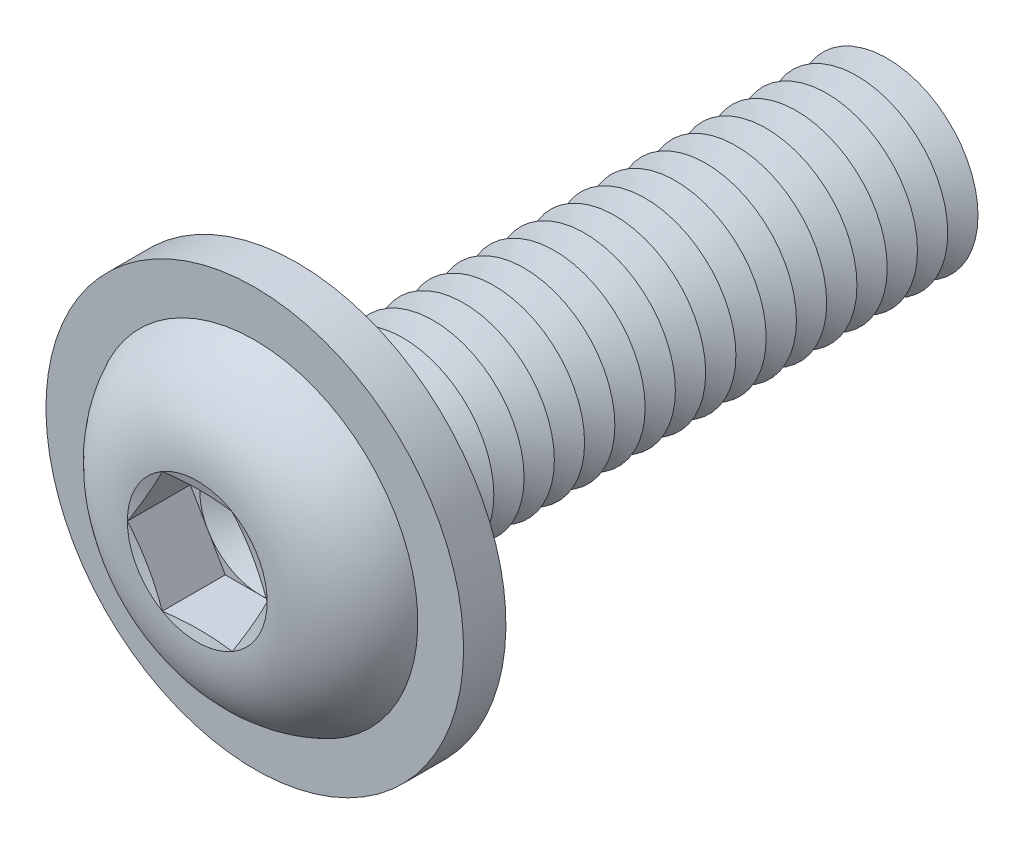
ISO-10303-21;
HEADER;
FILE_DESCRIPTION(('STEP AP214'),'2;1');
FILE_NAME('part.step','',(''),(''),'','','');
FILE_SCHEMA(('AUTOMOTIVE_DESIGN { 1 0 10303 214 1 1 1 1 }'));
ENDSEC;
DATA;
#1=APPLICATION_CONTEXT('core data for automotive mechanical design processes');
#2=APPLICATION_PROTOCOL_DEFINITION('international standard','automotive_design',2000,#1);
#3=PRODUCT_CONTEXT('',#1,'mechanical');
#4=PRODUCT('Part','Part','',(#3));
#5=PRODUCT_RELATED_PRODUCT_CATEGORY('part','',(#4));
#6=PRODUCT_DEFINITION_FORMATION('','',#4);
#7=PRODUCT_DEFINITION_CONTEXT('part definition',#1,'design');
#8=PRODUCT_DEFINITION('design','',#6,#7);
#9=PRODUCT_DEFINITION_SHAPE('','',#8);
#10=(LENGTH_UNIT() NAMED_UNIT(*) SI_UNIT(.MILLI.,.METRE.));
#11=(NAMED_UNIT(*) PLANE_ANGLE_UNIT() SI_UNIT($,.RADIAN.));
#12=(NAMED_UNIT(*) SI_UNIT($,.STERADIAN.) SOLID_ANGLE_UNIT());
#13=UNCERTAINTY_MEASURE_WITH_UNIT(LENGTH_MEASURE(1.E-05),#10,'distance_accuracy_value','');
#14=(GEOMETRIC_REPRESENTATION_CONTEXT(3) GLOBAL_UNCERTAINTY_ASSIGNED_CONTEXT((#13)) GLOBAL_UNIT_ASSIGNED_CONTEXT((#10,
#11,#12)) REPRESENTATION_CONTEXT('',''));
#15=CARTESIAN_POINT('',(0.,0.,0.));
#16=DIRECTION('',(0.,0.,1.));
#17=DIRECTION('',(1.,0.,0.));
#18=AXIS2_PLACEMENT_3D('',#15,#16,#17);
#19=CARTESIAN_POINT('',(0.,0.,-8.25));
#20=DIRECTION('',(0.,0.,1.));
#21=DIRECTION('',(1.,0.,0.));
#22=AXIS2_PLACEMENT_3D('',#19,#20,#21);
#23=CONICAL_SURFACE('',#22,1.5,1.0471975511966);
#24=CARTESIAN_POINT('',(0.,0.,-8.5));
#25=DIRECTION('',(0.,0.,1.));
#26=DIRECTION('',(1.,0.,0.));
#27=AXIS2_PLACEMENT_3D('',#24,#25,#26);
#28=CIRCLE('',#27,1.06698729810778);
#29=CARTESIAN_POINT('',(1.06698729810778,0.,-8.5));
#30=VERTEX_POINT('',#29);
#31=EDGE_CURVE('E370',#30,#30,#28,.T.);
#32=ORIENTED_EDGE('',*,*,#31,.T.);
#33=EDGE_LOOP('',(#32));
#34=FACE_BOUND('',#33,.T.);
#35=CARTESIAN_POINT('',(0.,0.,-8.25));
#36=DIRECTION('',(0.,0.,1.));
#37=DIRECTION('',(1.,0.,0.));
#38=AXIS2_PLACEMENT_3D('',#35,#36,#37);
#39=CIRCLE('',#38,1.5);
#40=CARTESIAN_POINT('',(1.5,0.,-8.25));
#41=VERTEX_POINT('',#40);
#42=EDGE_CURVE('E366',#41,#41,#39,.T.);
#43=ORIENTED_EDGE('',*,*,#42,.F.);
#44=EDGE_LOOP('',(#43));
#45=FACE_BOUND('',#44,.T.);
#46=ADVANCED_FACE('F39',(#34,#45),#23,.T.);
#47=CARTESIAN_POINT('',(0.,0.,-8.5));
#48=DIRECTION('',(0.,0.,-1.));
#49=DIRECTION('',(-1.,0.,0.));
#50=AXIS2_PLACEMENT_3D('',#47,#48,#49);
#51=CONICAL_SURFACE('',#50,1.06698729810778,1.0471975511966);
#52=CARTESIAN_POINT('',(0.,0.,-8.75));
#53=DIRECTION('',(0.,0.,1.));
#54=DIRECTION('',(1.,0.,0.));
#55=AXIS2_PLACEMENT_3D('',#52,#53,#54);
#56=CIRCLE('',#55,1.5);
#57=CARTESIAN_POINT('',(1.5,0.,-8.75));
#58=VERTEX_POINT('',#57);
#59=EDGE_CURVE('E374',#58,#58,#56,.T.);
#60=ORIENTED_EDGE('',*,*,#59,.T.);
#61=EDGE_LOOP('',(#60));
#62=FACE_BOUND('',#61,.T.);
#63=ORIENTED_EDGE('',*,*,#31,.F.);
#64=EDGE_LOOP('',(#63));
#65=FACE_BOUND('',#64,.T.);
#66=ADVANCED_FACE('F509',(#62,#65),#51,.T.);
#67=CARTESIAN_POINT('',(0.,1.50000000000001,-10.));
#68=DIRECTION('',(0.,0.,-1.));
#69=DIRECTION('',(-1.,0.,0.));
#70=AXIS2_PLACEMENT_3D('',#67,#68,#69);
#71=PLANE('',#70);
#72=CARTESIAN_POINT('',(0.,0.,-10.));
#73=DIRECTION('',(0.,0.,1.));
#74=DIRECTION('',(1.,0.,0.));
#75=AXIS2_PLACEMENT_3D('',#72,#73,#74);
#76=CIRCLE('',#75,1.06698729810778);
#77=CARTESIAN_POINT('',(1.06698729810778,0.,-10.));
#78=VERTEX_POINT('',#77);
#79=EDGE_CURVE('E394',#78,#78,#76,.T.);
#80=ORIENTED_EDGE('',*,*,#79,.F.);
#81=EDGE_LOOP('',(#80));
#82=FACE_BOUND('',#81,.T.);
#83=ADVANCED_FACE('F515',(#82),#71,.T.);
#84=CARTESIAN_POINT('',(0.,0.,-9.75));
#85=DIRECTION('',(0.,0.,1.));
#86=DIRECTION('',(1.,0.,0.));
#87=AXIS2_PLACEMENT_3D('',#84,#85,#86);
#88=CONICAL_SURFACE('',#87,1.5,1.0471975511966);
#89=ORIENTED_EDGE('',*,*,#79,.T.);
#90=EDGE_LOOP('',(#89));
#91=FACE_BOUND('',#90,.T.);
#92=CARTESIAN_POINT('',(0.,0.,-9.75));
#93=DIRECTION('',(0.,0.,1.));
#94=DIRECTION('',(1.,0.,0.));
#95=AXIS2_PLACEMENT_3D('',#92,#93,#94);
#96=CIRCLE('',#95,1.5);
#97=CARTESIAN_POINT('',(1.5,0.,-9.75));
#98=VERTEX_POINT('',#97);
#99=EDGE_CURVE('E390',#98,#98,#96,.T.);
#100=ORIENTED_EDGE('',*,*,#99,.F.);
#101=EDGE_LOOP('',(#100));
#102=FACE_BOUND('',#101,.T.);
#103=ADVANCED_FACE('F534',(#91,#102),#88,.T.);
#104=CARTESIAN_POINT('',(0.,0.,-9.5));
#105=DIRECTION('',(0.,0.,-1.));
#106=DIRECTION('',(-1.,0.,0.));
#107=AXIS2_PLACEMENT_3D('',#104,#105,#106);
#108=CONICAL_SURFACE('',#107,1.06698729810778,1.0471975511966);
#109=ORIENTED_EDGE('',*,*,#99,.T.);
#110=EDGE_LOOP('',(#109));
#111=FACE_BOUND('',#110,.T.);
#112=CARTESIAN_POINT('',(0.,0.,-9.5));
#113=DIRECTION('',(0.,0.,1.));
#114=DIRECTION('',(1.,0.,0.));
#115=AXIS2_PLACEMENT_3D('',#112,#113,#114);
#116=CIRCLE('',#115,1.06698729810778);
#117=CARTESIAN_POINT('',(1.06698729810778,0.,-9.5));
#118=VERTEX_POINT('',#117);
#119=EDGE_CURVE('E386',#118,#118,#116,.T.);
#120=ORIENTED_EDGE('',*,*,#119,.F.);
#121=EDGE_LOOP('',(#120));
#122=FACE_BOUND('',#121,.T.);
#123=ADVANCED_FACE('F531',(#111,#122),#108,.T.);
#124=CARTESIAN_POINT('',(0.,0.,-9.25));
#125=DIRECTION('',(0.,0.,1.));
#126=DIRECTION('',(1.,0.,0.));
#127=AXIS2_PLACEMENT_3D('',#124,#125,#126);
#128=CONICAL_SURFACE('',#127,1.5,1.0471975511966);
#129=ORIENTED_EDGE('',*,*,#119,.T.);
#130=EDGE_LOOP('',(#129));
#131=FACE_BOUND('',#130,.T.);
#132=CARTESIAN_POINT('',(0.,0.,-9.25));
#133=DIRECTION('',(0.,0.,1.));
#134=DIRECTION('',(1.,0.,0.));
#135=AXIS2_PLACEMENT_3D('',#132,#133,#134);
#136=CIRCLE('',#135,1.5);
#137=CARTESIAN_POINT('',(1.5,0.,-9.25));
#138=VERTEX_POINT('',#137);
#139=EDGE_CURVE('E382',#138,#138,#136,.T.);
#140=ORIENTED_EDGE('',*,*,#139,.F.);
#141=EDGE_LOOP('',(#140));
#142=FACE_BOUND('',#141,.T.);
#143=ADVANCED_FACE('F525',(#131,#142),#128,.T.);
#144=CARTESIAN_POINT('',(0.,0.,-9.));
#145=DIRECTION('',(0.,0.,-1.));
#146=DIRECTION('',(-1.,0.,0.));
#147=AXIS2_PLACEMENT_3D('',#144,#145,#146);
#148=CONICAL_SURFACE('',#147,1.06698729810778,1.0471975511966);
#149=ORIENTED_EDGE('',*,*,#139,.T.);
#150=EDGE_LOOP('',(#149));
#151=FACE_BOUND('',#150,.T.);
#152=CARTESIAN_POINT('',(0.,0.,-9.));
#153=DIRECTION('',(0.,0.,1.));
#154=DIRECTION('',(1.,0.,0.));
#155=AXIS2_PLACEMENT_3D('',#152,#153,#154);
#156=CIRCLE('',#155,1.06698729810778);
#157=CARTESIAN_POINT('',(1.06698729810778,0.,-9.));
#158=VERTEX_POINT('',#157);
#159=EDGE_CURVE('E378',#158,#158,#156,.T.);
#160=ORIENTED_EDGE('',*,*,#159,.F.);
#161=EDGE_LOOP('',(#160));
#162=FACE_BOUND('',#161,.T.);
#163=ADVANCED_FACE('F521',(#151,#162),#148,.T.);
#164=CARTESIAN_POINT('',(0.,0.,-8.75));
#165=DIRECTION('',(0.,0.,1.));
#166=DIRECTION('',(1.,0.,0.));
#167=AXIS2_PLACEMENT_3D('',#164,#165,#166);
#168=CONICAL_SURFACE('',#167,1.5,1.0471975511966);
#169=ORIENTED_EDGE('',*,*,#159,.T.);
#170=EDGE_LOOP('',(#169));
#171=FACE_BOUND('',#170,.T.);
#172=ORIENTED_EDGE('',*,*,#59,.F.);
#173=EDGE_LOOP('',(#172));
#174=FACE_BOUND('',#173,.T.);
#175=ADVANCED_FACE('F524',(#171,#174),#168,.T.);
#176=CARTESIAN_POINT('',(0.,0.,-7.75));
#177=DIRECTION('',(0.,0.,1.));
#178=DIRECTION('',(1.,0.,0.));
#179=AXIS2_PLACEMENT_3D('',#176,#177,#178);
#180=CONICAL_SURFACE('',#179,1.5,1.0471975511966);
#181=CARTESIAN_POINT('',(0.,0.,-8.));
#182=DIRECTION('',(0.,0.,1.));
#183=DIRECTION('',(1.,0.,0.));
#184=AXIS2_PLACEMENT_3D('',#181,#182,#183);
#185=CIRCLE('',#184,1.06698729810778);
#186=CARTESIAN_POINT('',(1.06698729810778,0.,-8.));
#187=VERTEX_POINT('',#186);
#188=EDGE_CURVE('E362',#187,#187,#185,.T.);
#189=ORIENTED_EDGE('',*,*,#188,.T.);
#190=EDGE_LOOP('',(#189));
#191=FACE_BOUND('',#190,.T.);
#192=CARTESIAN_POINT('',(0.,0.,-7.75));
#193=DIRECTION('',(0.,0.,1.));
#194=DIRECTION('',(1.,0.,0.));
#195=AXIS2_PLACEMENT_3D('',#192,#193,#194);
#196=CIRCLE('',#195,1.5);
#197=CARTESIAN_POINT('',(1.5,0.,-7.75));
#198=VERTEX_POINT('',#197);
#199=EDGE_CURVE('E358',#198,#198,#196,.T.);
#200=ORIENTED_EDGE('',*,*,#199,.F.);
#201=EDGE_LOOP('',(#200));
#202=FACE_BOUND('',#201,.T.);
#203=ADVANCED_FACE('F529',(#191,#202),#180,.T.);
#204=CARTESIAN_POINT('',(0.,0.,-8.));
#205=DIRECTION('',(0.,0.,-1.));
#206=DIRECTION('',(-1.,0.,0.));
#207=AXIS2_PLACEMENT_3D('',#204,#205,#206);
#208=CONICAL_SURFACE('',#207,1.06698729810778,1.0471975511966);
#209=ORIENTED_EDGE('',*,*,#42,.T.);
#210=EDGE_LOOP('',(#209));
#211=FACE_BOUND('',#210,.T.);
#212=ORIENTED_EDGE('',*,*,#188,.F.);
#213=EDGE_LOOP('',(#212));
#214=FACE_BOUND('',#213,.T.);
#215=ADVANCED_FACE('F580',(#211,#214),#208,.T.);
#216=CARTESIAN_POINT('',(0.,0.,-7.25));
#217=DIRECTION('',(0.,0.,1.));
#218=DIRECTION('',(1.,0.,0.));
#219=AXIS2_PLACEMENT_3D('',#216,#217,#218);
#220=CONICAL_SURFACE('',#219,1.5,1.0471975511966);
#221=CARTESIAN_POINT('',(0.,0.,-7.5));
#222=DIRECTION('',(0.,0.,1.));
#223=DIRECTION('',(1.,0.,0.));
#224=AXIS2_PLACEMENT_3D('',#221,#222,#223);
#225=CIRCLE('',#224,1.06698729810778);
#226=CARTESIAN_POINT('',(1.06698729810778,0.,-7.5));
#227=VERTEX_POINT('',#226);
#228=EDGE_CURVE('E354',#227,#227,#225,.T.);
#229=ORIENTED_EDGE('',*,*,#228,.T.);
#230=EDGE_LOOP('',(#229));
#231=FACE_BOUND('',#230,.T.);
#232=CARTESIAN_POINT('',(0.,0.,-7.25));
#233=DIRECTION('',(0.,0.,1.));
#234=DIRECTION('',(1.,0.,0.));
#235=AXIS2_PLACEMENT_3D('',#232,#233,#234);
#236=CIRCLE('',#235,1.5);
#237=CARTESIAN_POINT('',(1.5,0.,-7.25));
#238=VERTEX_POINT('',#237);
#239=EDGE_CURVE('E350',#238,#238,#236,.T.);
#240=ORIENTED_EDGE('',*,*,#239,.F.);
#241=EDGE_LOOP('',(#240));
#242=FACE_BOUND('',#241,.T.);
#243=ADVANCED_FACE('F586',(#231,#242),#220,.T.);
#244=CARTESIAN_POINT('',(0.,0.,-7.5));
#245=DIRECTION('',(0.,0.,-1.));
#246=DIRECTION('',(-1.,0.,0.));
#247=AXIS2_PLACEMENT_3D('',#244,#245,#246);
#248=CONICAL_SURFACE('',#247,1.06698729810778,1.0471975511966);
#249=ORIENTED_EDGE('',*,*,#199,.T.);
#250=EDGE_LOOP('',(#249));
#251=FACE_BOUND('',#250,.T.);
#252=ORIENTED_EDGE('',*,*,#228,.F.);
#253=EDGE_LOOP('',(#252));
#254=FACE_BOUND('',#253,.T.);
#255=ADVANCED_FACE('F593',(#251,#254),#248,.T.);
#256=CARTESIAN_POINT('',(0.,0.,-6.75));
#257=DIRECTION('',(0.,0.,1.));
#258=DIRECTION('',(1.,0.,0.));
#259=AXIS2_PLACEMENT_3D('',#256,#257,#258);
#260=CONICAL_SURFACE('',#259,1.5,1.0471975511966);
#261=CARTESIAN_POINT('',(0.,0.,-7.));
#262=DIRECTION('',(0.,0.,1.));
#263=DIRECTION('',(1.,0.,0.));
#264=AXIS2_PLACEMENT_3D('',#261,#262,#263);
#265=CIRCLE('',#264,1.06698729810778);
#266=CARTESIAN_POINT('',(1.06698729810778,0.,-7.));
#267=VERTEX_POINT('',#266);
#268=EDGE_CURVE('E346',#267,#267,#265,.T.);
#269=ORIENTED_EDGE('',*,*,#268,.T.);
#270=EDGE_LOOP('',(#269));
#271=FACE_BOUND('',#270,.T.);
#272=CARTESIAN_POINT('',(0.,0.,-6.75));
#273=DIRECTION('',(0.,0.,1.));
#274=DIRECTION('',(1.,0.,0.));
#275=AXIS2_PLACEMENT_3D('',#272,#273,#274);
#276=CIRCLE('',#275,1.5);
#277=CARTESIAN_POINT('',(1.5,0.,-6.75));
#278=VERTEX_POINT('',#277);
#279=EDGE_CURVE('E342',#278,#278,#276,.T.);
#280=ORIENTED_EDGE('',*,*,#279,.F.);
#281=EDGE_LOOP('',(#280));
#282=FACE_BOUND('',#281,.T.);
#283=ADVANCED_FACE('F600',(#271,#282),#260,.T.);
#284=CARTESIAN_POINT('',(0.,0.,-7.));
#285=DIRECTION('',(0.,0.,-1.));
#286=DIRECTION('',(-1.,0.,0.));
#287=AXIS2_PLACEMENT_3D('',#284,#285,#286);
#288=CONICAL_SURFACE('',#287,1.06698729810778,1.0471975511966);
#289=ORIENTED_EDGE('',*,*,#239,.T.);
#290=EDGE_LOOP('',(#289));
#291=FACE_BOUND('',#290,.T.);
#292=ORIENTED_EDGE('',*,*,#268,.F.);
#293=EDGE_LOOP('',(#292));
#294=FACE_BOUND('',#293,.T.);
#295=ADVANCED_FACE('F607',(#291,#294),#288,.T.);
#296=CARTESIAN_POINT('',(0.,0.,-6.25));
#297=DIRECTION('',(0.,0.,1.));
#298=DIRECTION('',(1.,0.,0.));
#299=AXIS2_PLACEMENT_3D('',#296,#297,#298);
#300=CONICAL_SURFACE('',#299,1.5,1.0471975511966);
#301=CARTESIAN_POINT('',(0.,0.,-6.5));
#302=DIRECTION('',(0.,0.,1.));
#303=DIRECTION('',(1.,0.,0.));
#304=AXIS2_PLACEMENT_3D('',#301,#302,#303);
#305=CIRCLE('',#304,1.06698729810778);
#306=CARTESIAN_POINT('',(1.06698729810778,0.,-6.5));
#307=VERTEX_POINT('',#306);
#308=EDGE_CURVE('E338',#307,#307,#305,.T.);
#309=ORIENTED_EDGE('',*,*,#308,.T.);
#310=EDGE_LOOP('',(#309));
#311=FACE_BOUND('',#310,.T.);
#312=CARTESIAN_POINT('',(0.,0.,-6.25));
#313=DIRECTION('',(0.,0.,1.));
#314=DIRECTION('',(1.,0.,0.));
#315=AXIS2_PLACEMENT_3D('',#312,#313,#314);
#316=CIRCLE('',#315,1.5);
#317=CARTESIAN_POINT('',(1.5,0.,-6.25));
#318=VERTEX_POINT('',#317);
#319=EDGE_CURVE('E334',#318,#318,#316,.T.);
#320=ORIENTED_EDGE('',*,*,#319,.F.);
#321=EDGE_LOOP('',(#320));
#322=FACE_BOUND('',#321,.T.);
#323=ADVANCED_FACE('F614',(#311,#322),#300,.T.);
#324=CARTESIAN_POINT('',(0.,0.,-6.5));
#325=DIRECTION('',(0.,0.,-1.));
#326=DIRECTION('',(-1.,0.,0.));
#327=AXIS2_PLACEMENT_3D('',#324,#325,#326);
#328=CONICAL_SURFACE('',#327,1.06698729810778,1.0471975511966);
#329=ORIENTED_EDGE('',*,*,#279,.T.);
#330=EDGE_LOOP('',(#329));
#331=FACE_BOUND('',#330,.T.);
#332=ORIENTED_EDGE('',*,*,#308,.F.);
#333=EDGE_LOOP('',(#332));
#334=FACE_BOUND('',#333,.T.);
#335=ADVANCED_FACE('F621',(#331,#334),#328,.T.);
#336=CARTESIAN_POINT('',(0.,0.,-5.75));
#337=DIRECTION('',(0.,0.,1.));
#338=DIRECTION('',(1.,0.,0.));
#339=AXIS2_PLACEMENT_3D('',#336,#337,#338);
#340=CONICAL_SURFACE('',#339,1.5,1.0471975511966);
#341=CARTESIAN_POINT('',(0.,0.,-6.));
#342=DIRECTION('',(0.,0.,1.));
#343=DIRECTION('',(1.,0.,0.));
#344=AXIS2_PLACEMENT_3D('',#341,#342,#343);
#345=CIRCLE('',#344,1.06698729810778);
#346=CARTESIAN_POINT('',(1.06698729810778,0.,-6.));
#347=VERTEX_POINT('',#346);
#348=EDGE_CURVE('E330',#347,#347,#345,.T.);
#349=ORIENTED_EDGE('',*,*,#348,.T.);
#350=EDGE_LOOP('',(#349));
#351=FACE_BOUND('',#350,.T.);
#352=CARTESIAN_POINT('',(0.,0.,-5.75));
#353=DIRECTION('',(0.,0.,1.));
#354=DIRECTION('',(1.,0.,0.));
#355=AXIS2_PLACEMENT_3D('',#352,#353,#354);
#356=CIRCLE('',#355,1.5);
#357=CARTESIAN_POINT('',(1.5,0.,-5.75));
#358=VERTEX_POINT('',#357);
#359=EDGE_CURVE('E326',#358,#358,#356,.T.);
#360=ORIENTED_EDGE('',*,*,#359,.F.);
#361=EDGE_LOOP('',(#360));
#362=FACE_BOUND('',#361,.T.);
#363=ADVANCED_FACE('F628',(#351,#362),#340,.T.);
#364=CARTESIAN_POINT('',(0.,0.,-6.));
#365=DIRECTION('',(0.,0.,-1.));
#366=DIRECTION('',(-1.,0.,0.));
#367=AXIS2_PLACEMENT_3D('',#364,#365,#366);
#368=CONICAL_SURFACE('',#367,1.06698729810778,1.0471975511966);
#369=ORIENTED_EDGE('',*,*,#319,.T.);
#370=EDGE_LOOP('',(#369));
#371=FACE_BOUND('',#370,.T.);
#372=ORIENTED_EDGE('',*,*,#348,.F.);
#373=EDGE_LOOP('',(#372));
#374=FACE_BOUND('',#373,.T.);
#375=ADVANCED_FACE('F635',(#371,#374),#368,.T.);
#376=CARTESIAN_POINT('',(0.,0.,-5.25));
#377=DIRECTION('',(0.,0.,1.));
#378=DIRECTION('',(1.,0.,0.));
#379=AXIS2_PLACEMENT_3D('',#376,#377,#378);
#380=CONICAL_SURFACE('',#379,1.5,1.0471975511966);
#381=CARTESIAN_POINT('',(0.,0.,-5.5));
#382=DIRECTION('',(0.,0.,1.));
#383=DIRECTION('',(1.,0.,0.));
#384=AXIS2_PLACEMENT_3D('',#381,#382,#383);
#385=CIRCLE('',#384,1.06698729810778);
#386=CARTESIAN_POINT('',(1.06698729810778,0.,-5.5));
#387=VERTEX_POINT('',#386);
#388=EDGE_CURVE('E322',#387,#387,#385,.T.);
#389=ORIENTED_EDGE('',*,*,#388,.T.);
#390=EDGE_LOOP('',(#389));
#391=FACE_BOUND('',#390,.T.);
#392=CARTESIAN_POINT('',(0.,0.,-5.25));
#393=DIRECTION('',(0.,0.,1.));
#394=DIRECTION('',(1.,0.,0.));
#395=AXIS2_PLACEMENT_3D('',#392,#393,#394);
#396=CIRCLE('',#395,1.5);
#397=CARTESIAN_POINT('',(1.5,0.,-5.25));
#398=VERTEX_POINT('',#397);
#399=EDGE_CURVE('E318',#398,#398,#396,.T.);
#400=ORIENTED_EDGE('',*,*,#399,.F.);
#401=EDGE_LOOP('',(#400));
#402=FACE_BOUND('',#401,.T.);
#403=ADVANCED_FACE('F642',(#391,#402),#380,.T.);
#404=CARTESIAN_POINT('',(0.,0.,-5.5));
#405=DIRECTION('',(0.,0.,-1.));
#406=DIRECTION('',(-1.,0.,0.));
#407=AXIS2_PLACEMENT_3D('',#404,#405,#406);
#408=CONICAL_SURFACE('',#407,1.06698729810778,1.0471975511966);
#409=ORIENTED_EDGE('',*,*,#359,.T.);
#410=EDGE_LOOP('',(#409));
#411=FACE_BOUND('',#410,.T.);
#412=ORIENTED_EDGE('',*,*,#388,.F.);
#413=EDGE_LOOP('',(#412));
#414=FACE_BOUND('',#413,.T.);
#415=ADVANCED_FACE('F649',(#411,#414),#408,.T.);
#416=CARTESIAN_POINT('',(0.,0.,-4.75));
#417=DIRECTION('',(0.,0.,1.));
#418=DIRECTION('',(1.,0.,0.));
#419=AXIS2_PLACEMENT_3D('',#416,#417,#418);
#420=CONICAL_SURFACE('',#419,1.5,1.0471975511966);
#421=CARTESIAN_POINT('',(0.,0.,-5.));
#422=DIRECTION('',(0.,0.,1.));
#423=DIRECTION('',(1.,0.,0.));
#424=AXIS2_PLACEMENT_3D('',#421,#422,#423);
#425=CIRCLE('',#424,1.06698729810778);
#426=CARTESIAN_POINT('',(1.06698729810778,0.,-5.));
#427=VERTEX_POINT('',#426);
#428=EDGE_CURVE('E314',#427,#427,#425,.T.);
#429=ORIENTED_EDGE('',*,*,#428,.T.);
#430=EDGE_LOOP('',(#429));
#431=FACE_BOUND('',#430,.T.);
#432=CARTESIAN_POINT('',(0.,0.,-4.75));
#433=DIRECTION('',(0.,0.,1.));
#434=DIRECTION('',(1.,0.,0.));
#435=AXIS2_PLACEMENT_3D('',#432,#433,#434);
#436=CIRCLE('',#435,1.5);
#437=CARTESIAN_POINT('',(1.5,0.,-4.75));
#438=VERTEX_POINT('',#437);
#439=EDGE_CURVE('E310',#438,#438,#436,.T.);
#440=ORIENTED_EDGE('',*,*,#439,.F.);
#441=EDGE_LOOP('',(#440));
#442=FACE_BOUND('',#441,.T.);
#443=ADVANCED_FACE('F656',(#431,#442),#420,.T.);
#444=CARTESIAN_POINT('',(0.,0.,-5.));
#445=DIRECTION('',(0.,0.,-1.));
#446=DIRECTION('',(-1.,0.,0.));
#447=AXIS2_PLACEMENT_3D('',#444,#445,#446);
#448=CONICAL_SURFACE('',#447,1.06698729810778,1.0471975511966);
#449=ORIENTED_EDGE('',*,*,#399,.T.);
#450=EDGE_LOOP('',(#449));
#451=FACE_BOUND('',#450,.T.);
#452=ORIENTED_EDGE('',*,*,#428,.F.);
#453=EDGE_LOOP('',(#452));
#454=FACE_BOUND('',#453,.T.);
#455=ADVANCED_FACE('F663',(#451,#454),#448,.T.);
#456=CARTESIAN_POINT('',(0.,0.,-4.25));
#457=DIRECTION('',(0.,0.,1.));
#458=DIRECTION('',(1.,0.,0.));
#459=AXIS2_PLACEMENT_3D('',#456,#457,#458);
#460=CONICAL_SURFACE('',#459,1.5,1.0471975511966);
#461=CARTESIAN_POINT('',(0.,0.,-4.5));
#462=DIRECTION('',(0.,0.,1.));
#463=DIRECTION('',(1.,0.,0.));
#464=AXIS2_PLACEMENT_3D('',#461,#462,#463);
#465=CIRCLE('',#464,1.06698729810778);
#466=CARTESIAN_POINT('',(1.06698729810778,0.,-4.5));
#467=VERTEX_POINT('',#466);
#468=EDGE_CURVE('E306',#467,#467,#465,.T.);
#469=ORIENTED_EDGE('',*,*,#468,.T.);
#470=EDGE_LOOP('',(#469));
#471=FACE_BOUND('',#470,.T.);
#472=CARTESIAN_POINT('',(0.,0.,-4.25));
#473=DIRECTION('',(0.,0.,1.));
#474=DIRECTION('',(1.,0.,0.));
#475=AXIS2_PLACEMENT_3D('',#472,#473,#474);
#476=CIRCLE('',#475,1.5);
#477=CARTESIAN_POINT('',(1.5,0.,-4.25));
#478=VERTEX_POINT('',#477);
#479=EDGE_CURVE('E302',#478,#478,#476,.T.);
#480=ORIENTED_EDGE('',*,*,#479,.F.);
#481=EDGE_LOOP('',(#480));
#482=FACE_BOUND('',#481,.T.);
#483=ADVANCED_FACE('F670',(#471,#482),#460,.T.);
#484=CARTESIAN_POINT('',(0.,0.,-4.5));
#485=DIRECTION('',(0.,0.,-1.));
#486=DIRECTION('',(-1.,0.,0.));
#487=AXIS2_PLACEMENT_3D('',#484,#485,#486);
#488=CONICAL_SURFACE('',#487,1.06698729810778,1.0471975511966);
#489=ORIENTED_EDGE('',*,*,#439,.T.);
#490=EDGE_LOOP('',(#489));
#491=FACE_BOUND('',#490,.T.);
#492=ORIENTED_EDGE('',*,*,#468,.F.);
#493=EDGE_LOOP('',(#492));
#494=FACE_BOUND('',#493,.T.);
#495=ADVANCED_FACE('F677',(#491,#494),#488,.T.);
#496=CARTESIAN_POINT('',(0.,0.,-3.75));
#497=DIRECTION('',(0.,0.,1.));
#498=DIRECTION('',(1.,0.,0.));
#499=AXIS2_PLACEMENT_3D('',#496,#497,#498);
#500=CONICAL_SURFACE('',#499,1.5,1.0471975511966);
#501=CARTESIAN_POINT('',(0.,0.,-4.));
#502=DIRECTION('',(0.,0.,1.));
#503=DIRECTION('',(1.,0.,0.));
#504=AXIS2_PLACEMENT_3D('',#501,#502,#503);
#505=CIRCLE('',#504,1.06698729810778);
#506=CARTESIAN_POINT('',(1.06698729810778,0.,-4.));
#507=VERTEX_POINT('',#506);
#508=EDGE_CURVE('E298',#507,#507,#505,.T.);
#509=ORIENTED_EDGE('',*,*,#508,.T.);
#510=EDGE_LOOP('',(#509));
#511=FACE_BOUND('',#510,.T.);
#512=CARTESIAN_POINT('',(0.,0.,-3.75));
#513=DIRECTION('',(0.,0.,1.));
#514=DIRECTION('',(1.,0.,0.));
#515=AXIS2_PLACEMENT_3D('',#512,#513,#514);
#516=CIRCLE('',#515,1.5);
#517=CARTESIAN_POINT('',(1.5,0.,-3.75));
#518=VERTEX_POINT('',#517);
#519=EDGE_CURVE('E294',#518,#518,#516,.T.);
#520=ORIENTED_EDGE('',*,*,#519,.F.);
#521=EDGE_LOOP('',(#520));
#522=FACE_BOUND('',#521,.T.);
#523=ADVANCED_FACE('F684',(#511,#522),#500,.T.);
#524=CARTESIAN_POINT('',(0.,0.,-4.));
#525=DIRECTION('',(0.,0.,-1.));
#526=DIRECTION('',(-1.,0.,0.));
#527=AXIS2_PLACEMENT_3D('',#524,#525,#526);
#528=CONICAL_SURFACE('',#527,1.06698729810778,1.0471975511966);
#529=ORIENTED_EDGE('',*,*,#479,.T.);
#530=EDGE_LOOP('',(#529));
#531=FACE_BOUND('',#530,.T.);
#532=ORIENTED_EDGE('',*,*,#508,.F.);
#533=EDGE_LOOP('',(#532));
#534=FACE_BOUND('',#533,.T.);
#535=ADVANCED_FACE('F691',(#531,#534),#528,.T.);
#536=CARTESIAN_POINT('',(0.,0.,-3.25));
#537=DIRECTION('',(0.,0.,1.));
#538=DIRECTION('',(1.,0.,0.));
#539=AXIS2_PLACEMENT_3D('',#536,#537,#538);
#540=CONICAL_SURFACE('',#539,1.5,1.0471975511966);
#541=CARTESIAN_POINT('',(0.,0.,-3.5));
#542=DIRECTION('',(0.,0.,1.));
#543=DIRECTION('',(1.,0.,0.));
#544=AXIS2_PLACEMENT_3D('',#541,#542,#543);
#545=CIRCLE('',#544,1.06698729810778);
#546=CARTESIAN_POINT('',(1.06698729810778,0.,-3.5));
#547=VERTEX_POINT('',#546);
#548=EDGE_CURVE('E290',#547,#547,#545,.T.);
#549=ORIENTED_EDGE('',*,*,#548,.T.);
#550=EDGE_LOOP('',(#549));
#551=FACE_BOUND('',#550,.T.);
#552=CARTESIAN_POINT('',(0.,0.,-3.25));
#553=DIRECTION('',(0.,0.,1.));
#554=DIRECTION('',(1.,0.,0.));
#555=AXIS2_PLACEMENT_3D('',#552,#553,#554);
#556=CIRCLE('',#555,1.5);
#557=CARTESIAN_POINT('',(1.5,0.,-3.25));
#558=VERTEX_POINT('',#557);
#559=EDGE_CURVE('E286',#558,#558,#556,.T.);
#560=ORIENTED_EDGE('',*,*,#559,.F.);
#561=EDGE_LOOP('',(#560));
#562=FACE_BOUND('',#561,.T.);
#563=ADVANCED_FACE('F698',(#551,#562),#540,.T.);
#564=CARTESIAN_POINT('',(0.,0.,-3.5));
#565=DIRECTION('',(0.,0.,-1.));
#566=DIRECTION('',(-1.,0.,0.));
#567=AXIS2_PLACEMENT_3D('',#564,#565,#566);
#568=CONICAL_SURFACE('',#567,1.06698729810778,1.0471975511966);
#569=ORIENTED_EDGE('',*,*,#519,.T.);
#570=EDGE_LOOP('',(#569));
#571=FACE_BOUND('',#570,.T.);
#572=ORIENTED_EDGE('',*,*,#548,.F.);
#573=EDGE_LOOP('',(#572));
#574=FACE_BOUND('',#573,.T.);
#575=ADVANCED_FACE('F705',(#571,#574),#568,.T.);
#576=CARTESIAN_POINT('',(0.,0.,-2.75));
#577=DIRECTION('',(0.,0.,1.));
#578=DIRECTION('',(1.,0.,0.));
#579=AXIS2_PLACEMENT_3D('',#576,#577,#578);
#580=CONICAL_SURFACE('',#579,1.5,1.0471975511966);
#581=CARTESIAN_POINT('',(0.,0.,-3.));
#582=DIRECTION('',(0.,0.,1.));
#583=DIRECTION('',(1.,0.,0.));
#584=AXIS2_PLACEMENT_3D('',#581,#582,#583);
#585=CIRCLE('',#584,1.06698729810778);
#586=CARTESIAN_POINT('',(1.06698729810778,0.,-3.));
#587=VERTEX_POINT('',#586);
#588=EDGE_CURVE('E283',#587,#587,#585,.T.);
#589=ORIENTED_EDGE('',*,*,#588,.T.);
#590=EDGE_LOOP('',(#589));
#591=FACE_BOUND('',#590,.T.);
#592=CARTESIAN_POINT('',(0.,0.,-2.75));
#593=DIRECTION('',(0.,0.,1.));
#594=DIRECTION('',(1.,0.,0.));
#595=AXIS2_PLACEMENT_3D('',#592,#593,#594);
#596=CIRCLE('',#595,1.5);
#597=CARTESIAN_POINT('',(1.5,0.,-2.75));
#598=VERTEX_POINT('',#597);
#599=EDGE_CURVE('E279',#598,#598,#596,.T.);
#600=ORIENTED_EDGE('',*,*,#599,.F.);
#601=EDGE_LOOP('',(#600));
#602=FACE_BOUND('',#601,.T.);
#603=ADVANCED_FACE('F712',(#591,#602),#580,.T.);
#604=CARTESIAN_POINT('',(0.,0.,-3.));
#605=DIRECTION('',(0.,0.,-1.));
#606=DIRECTION('',(-1.,0.,0.));
#607=AXIS2_PLACEMENT_3D('',#604,#605,#606);
#608=CONICAL_SURFACE('',#607,1.06698729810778,1.0471975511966);
#609=ORIENTED_EDGE('',*,*,#559,.T.);
#610=EDGE_LOOP('',(#609));
#611=FACE_BOUND('',#610,.T.);
#612=ORIENTED_EDGE('',*,*,#588,.F.);
#613=EDGE_LOOP('',(#612));
#614=FACE_BOUND('',#613,.T.);
#615=ADVANCED_FACE('F719',(#611,#614),#608,.T.);
#616=CARTESIAN_POINT('',(0.,0.,-2.25));
#617=DIRECTION('',(0.,0.,1.));
#618=DIRECTION('',(1.,0.,0.));
#619=AXIS2_PLACEMENT_3D('',#616,#617,#618);
#620=CONICAL_SURFACE('',#619,1.5,1.0471975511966);
#621=CARTESIAN_POINT('',(0.,0.,-2.5));
#622=DIRECTION('',(0.,0.,1.));
#623=DIRECTION('',(1.,0.,0.));
#624=AXIS2_PLACEMENT_3D('',#621,#622,#623);
#625=CIRCLE('',#624,1.06698729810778);
#626=CARTESIAN_POINT('',(1.06698729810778,0.,-2.5));
#627=VERTEX_POINT('',#626);
#628=EDGE_CURVE('E275',#627,#627,#625,.T.);
#629=ORIENTED_EDGE('',*,*,#628,.T.);
#630=EDGE_LOOP('',(#629));
#631=FACE_BOUND('',#630,.T.);
#632=CARTESIAN_POINT('',(0.,0.,-2.25));
#633=DIRECTION('',(0.,0.,1.));
#634=DIRECTION('',(1.,0.,0.));
#635=AXIS2_PLACEMENT_3D('',#632,#633,#634);
#636=CIRCLE('',#635,1.5);
#637=CARTESIAN_POINT('',(1.5,0.,-2.25));
#638=VERTEX_POINT('',#637);
#639=EDGE_CURVE('E271',#638,#638,#636,.T.);
#640=ORIENTED_EDGE('',*,*,#639,.F.);
#641=EDGE_LOOP('',(#640));
#642=FACE_BOUND('',#641,.T.);
#643=ADVANCED_FACE('F726',(#631,#642),#620,.T.);
#644=CARTESIAN_POINT('',(0.,0.,-2.5));
#645=DIRECTION('',(0.,0.,-1.));
#646=DIRECTION('',(-1.,0.,0.));
#647=AXIS2_PLACEMENT_3D('',#644,#645,#646);
#648=CONICAL_SURFACE('',#647,1.06698729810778,1.0471975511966);
#649=ORIENTED_EDGE('',*,*,#599,.T.);
#650=EDGE_LOOP('',(#649));
#651=FACE_BOUND('',#650,.T.);
#652=ORIENTED_EDGE('',*,*,#628,.F.);
#653=EDGE_LOOP('',(#652));
#654=FACE_BOUND('',#653,.T.);
#655=ADVANCED_FACE('F733',(#651,#654),#648,.T.);
#656=CARTESIAN_POINT('',(0.,0.,-1.75));
#657=DIRECTION('',(0.,0.,1.));
#658=DIRECTION('',(1.,0.,0.));
#659=AXIS2_PLACEMENT_3D('',#656,#657,#658);
#660=CONICAL_SURFACE('',#659,1.5,1.0471975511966);
#661=CARTESIAN_POINT('',(0.,0.,-2.));
#662=DIRECTION('',(0.,0.,1.));
#663=DIRECTION('',(1.,0.,0.));
#664=AXIS2_PLACEMENT_3D('',#661,#662,#663);
#665=CIRCLE('',#664,1.06698729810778);
#666=CARTESIAN_POINT('',(1.06698729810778,0.,-2.));
#667=VERTEX_POINT('',#666);
#668=EDGE_CURVE('E267',#667,#667,#665,.T.);
#669=ORIENTED_EDGE('',*,*,#668,.T.);
#670=EDGE_LOOP('',(#669));
#671=FACE_BOUND('',#670,.T.);
#672=CARTESIAN_POINT('',(0.,0.,-1.75));
#673=DIRECTION('',(0.,0.,1.));
#674=DIRECTION('',(1.,0.,0.));
#675=AXIS2_PLACEMENT_3D('',#672,#673,#674);
#676=CIRCLE('',#675,1.5);
#677=CARTESIAN_POINT('',(1.5,0.,-1.75));
#678=VERTEX_POINT('',#677);
#679=EDGE_CURVE('E263',#678,#678,#676,.T.);
#680=ORIENTED_EDGE('',*,*,#679,.F.);
#681=EDGE_LOOP('',(#680));
#682=FACE_BOUND('',#681,.T.);
#683=ADVANCED_FACE('F740',(#671,#682),#660,.T.);
#684=CARTESIAN_POINT('',(0.,0.,-2.));
#685=DIRECTION('',(0.,0.,-1.));
#686=DIRECTION('',(-1.,0.,0.));
#687=AXIS2_PLACEMENT_3D('',#684,#685,#686);
#688=CONICAL_SURFACE('',#687,1.06698729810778,1.0471975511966);
#689=ORIENTED_EDGE('',*,*,#639,.T.);
#690=EDGE_LOOP('',(#689));
#691=FACE_BOUND('',#690,.T.);
#692=ORIENTED_EDGE('',*,*,#668,.F.);
#693=EDGE_LOOP('',(#692));
#694=FACE_BOUND('',#693,.T.);
#695=ADVANCED_FACE('F747',(#691,#694),#688,.T.);
#696=CARTESIAN_POINT('',(0.,0.,-1.25));
#697=DIRECTION('',(0.,0.,1.));
#698=DIRECTION('',(1.,0.,0.));
#699=AXIS2_PLACEMENT_3D('',#696,#697,#698);
#700=CONICAL_SURFACE('',#699,1.5,1.0471975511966);
#701=CARTESIAN_POINT('',(0.,0.,-1.5));
#702=DIRECTION('',(0.,0.,1.));
#703=DIRECTION('',(1.,0.,0.));
#704=AXIS2_PLACEMENT_3D('',#701,#702,#703);
#705=CIRCLE('',#704,1.06698729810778);
#706=CARTESIAN_POINT('',(1.06698729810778,0.,-1.5));
#707=VERTEX_POINT('',#706);
#708=EDGE_CURVE('E259',#707,#707,#705,.T.);
#709=ORIENTED_EDGE('',*,*,#708,.T.);
#710=EDGE_LOOP('',(#709));
#711=FACE_BOUND('',#710,.T.);
#712=CARTESIAN_POINT('',(0.,0.,-1.25));
#713=DIRECTION('',(0.,0.,1.));
#714=DIRECTION('',(1.,0.,0.));
#715=AXIS2_PLACEMENT_3D('',#712,#713,#714);
#716=CIRCLE('',#715,1.5);
#717=CARTESIAN_POINT('',(1.5,0.,-1.25));
#718=VERTEX_POINT('',#717);
#719=EDGE_CURVE('E255',#718,#718,#716,.T.);
#720=ORIENTED_EDGE('',*,*,#719,.F.);
#721=EDGE_LOOP('',(#720));
#722=FACE_BOUND('',#721,.T.);
#723=ADVANCED_FACE('F754',(#711,#722),#700,.T.);
#724=CARTESIAN_POINT('',(0.,0.,-1.5));
#725=DIRECTION('',(0.,0.,-1.));
#726=DIRECTION('',(-1.,0.,0.));
#727=AXIS2_PLACEMENT_3D('',#724,#725,#726);
#728=CONICAL_SURFACE('',#727,1.06698729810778,1.0471975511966);
#729=ORIENTED_EDGE('',*,*,#679,.T.);
#730=EDGE_LOOP('',(#729));
#731=FACE_BOUND('',#730,.T.);
#732=ORIENTED_EDGE('',*,*,#708,.F.);
#733=EDGE_LOOP('',(#732));
#734=FACE_BOUND('',#733,.T.);
#735=ADVANCED_FACE('F761',(#731,#734),#728,.T.);
#736=CARTESIAN_POINT('',(0.,0.,-0.750000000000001));
#737=DIRECTION('',(0.,0.,1.));
#738=DIRECTION('',(1.,0.,0.));
#739=AXIS2_PLACEMENT_3D('',#736,#737,#738);
#740=CONICAL_SURFACE('',#739,1.5,1.0471975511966);
#741=CARTESIAN_POINT('',(0.,0.,-1.));
#742=DIRECTION('',(0.,0.,1.));
#743=DIRECTION('',(1.,0.,0.));
#744=AXIS2_PLACEMENT_3D('',#741,#742,#743);
#745=CIRCLE('',#744,1.06698729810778);
#746=CARTESIAN_POINT('',(1.06698729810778,0.,-1.));
#747=VERTEX_POINT('',#746);
#748=EDGE_CURVE('E251',#747,#747,#745,.T.);
#749=ORIENTED_EDGE('',*,*,#748,.T.);
#750=EDGE_LOOP('',(#749));
#751=FACE_BOUND('',#750,.T.);
#752=CARTESIAN_POINT('',(0.,0.,-0.750000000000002));
#753=DIRECTION('',(0.,0.,1.));
#754=DIRECTION('',(1.,0.,0.));
#755=AXIS2_PLACEMENT_3D('',#752,#753,#754);
#756=CIRCLE('',#755,1.5);
#757=CARTESIAN_POINT('',(1.5,0.,-0.750000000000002));
#758=VERTEX_POINT('',#757);
#759=EDGE_CURVE('E243',#758,#758,#756,.T.);
#760=ORIENTED_EDGE('',*,*,#759,.F.);
#761=EDGE_LOOP('',(#760));
#762=FACE_BOUND('',#761,.T.);
#763=ADVANCED_FACE('F768',(#751,#762),#740,.T.);
#764=CARTESIAN_POINT('',(0.,0.,-1.));
#765=DIRECTION('',(0.,0.,-1.));
#766=DIRECTION('',(-1.,0.,0.));
#767=AXIS2_PLACEMENT_3D('',#764,#765,#766);
#768=CONICAL_SURFACE('',#767,1.06698729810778,1.0471975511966);
#769=ORIENTED_EDGE('',*,*,#719,.T.);
#770=EDGE_LOOP('',(#769));
#771=FACE_BOUND('',#770,.T.);
#772=ORIENTED_EDGE('',*,*,#748,.F.);
#773=EDGE_LOOP('',(#772));
#774=FACE_BOUND('',#773,.T.);
#775=ADVANCED_FACE('F775',(#771,#774),#768,.T.);
#776=CARTESIAN_POINT('',(0.,0.,-0.250000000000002));
#777=DIRECTION('',(0.,0.,1.));
#778=DIRECTION('',(1.,0.,0.));
#779=AXIS2_PLACEMENT_3D('',#776,#777,#778);
#780=CONICAL_SURFACE('',#779,1.5,1.0471975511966);
#781=CARTESIAN_POINT('',(0.,0.,-0.500000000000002));
#782=DIRECTION('',(0.,0.,1.));
#783=DIRECTION('',(1.,0.,0.));
#784=AXIS2_PLACEMENT_3D('',#781,#782,#783);
#785=CIRCLE('',#784,1.06698729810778);
#786=CARTESIAN_POINT('',(1.06698729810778,0.,-0.500000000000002));
#787=VERTEX_POINT('',#786);
#788=EDGE_CURVE('E232',#787,#787,#785,.T.);
#789=ORIENTED_EDGE('',*,*,#788,.T.);
#790=EDGE_LOOP('',(#789));
#791=FACE_BOUND('',#790,.T.);
#792=CARTESIAN_POINT('',(0.,0.,-0.250000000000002));
#793=DIRECTION('',(0.,0.,1.));
#794=DIRECTION('',(1.,0.,0.));
#795=AXIS2_PLACEMENT_3D('',#792,#793,#794);
#796=CIRCLE('',#795,1.5);
#797=CARTESIAN_POINT('',(1.5,0.,-0.250000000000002));
#798=VERTEX_POINT('',#797);
#799=EDGE_CURVE('E247',#798,#798,#796,.T.);
#800=ORIENTED_EDGE('',*,*,#799,.F.);
#801=EDGE_LOOP('',(#800));
#802=FACE_BOUND('',#801,.T.);
#803=ADVANCED_FACE('F782',(#791,#802),#780,.T.);
#804=CARTESIAN_POINT('',(0.,0.,-0.500000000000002));
#805=DIRECTION('',(0.,0.,-1.));
#806=DIRECTION('',(-1.,0.,0.));
#807=AXIS2_PLACEMENT_3D('',#804,#805,#806);
#808=CONICAL_SURFACE('',#807,1.06698729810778,1.0471975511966);
#809=ORIENTED_EDGE('',*,*,#759,.T.);
#810=EDGE_LOOP('',(#809));
#811=FACE_BOUND('',#810,.T.);
#812=ORIENTED_EDGE('',*,*,#788,.F.);
#813=EDGE_LOOP('',(#812));
#814=FACE_BOUND('',#813,.T.);
#815=ADVANCED_FACE('F221',(#811,#814),#808,.T.);
#816=CARTESIAN_POINT('',(0.,1.5,0.));
#817=DIRECTION('',(0.,0.,-1.));
#818=DIRECTION('',(-1.,0.,0.));
#819=AXIS2_PLACEMENT_3D('',#816,#817,#818);
#820=PLANE('',#819);
#821=CARTESIAN_POINT('',(0.,0.,0.));
#822=DIRECTION('',(0.,0.,-1.));
#823=DIRECTION('',(-1.,0.,0.));
#824=AXIS2_PLACEMENT_3D('',#821,#822,#823);
#825=CIRCLE('',#824,1.75);
#826=CARTESIAN_POINT('',(-1.75,0.,0.));
#827=VERTEX_POINT('',#826);
#828=EDGE_CURVE('E403',#827,#827,#825,.F.);
#829=ORIENTED_EDGE('',*,*,#828,.T.);
#830=EDGE_LOOP('',(#829));
#831=FACE_BOUND('',#830,.T.);
#832=CARTESIAN_POINT('',(0.,0.,0.));
#833=DIRECTION('',(0.,0.,-1.));
#834=DIRECTION('',(0.,1.,0.));
#835=AXIS2_PLACEMENT_3D('',#832,#833,#834);
#836=CIRCLE('',#835,3.45);
#837=CARTESIAN_POINT('',(0.,3.45,0.));
#838=VERTEX_POINT('',#837);
#839=EDGE_CURVE('E1158',#838,#838,#836,.T.);
#840=ORIENTED_EDGE('',*,*,#839,.T.);
#841=EDGE_LOOP('',(#840));
#842=FACE_BOUND('',#841,.T.);
#843=ADVANCED_FACE('F794',(#831,#842),#820,.T.);
#844=CARTESIAN_POINT('',(0.,0.,-0.25));
#845=DIRECTION('',(0.,0.,-1.));
#846=DIRECTION('',(-1.,0.,0.));
#847=AXIS2_PLACEMENT_3D('',#844,#845,#846);
#848=TOROIDAL_SURFACE('',#847,1.75,0.25);
#849=ORIENTED_EDGE('',*,*,#828,.F.);
#850=EDGE_LOOP('',(#849));
#851=FACE_BOUND('',#850,.T.);
#852=ORIENTED_EDGE('',*,*,#799,.T.);
#853=EDGE_LOOP('',(#852));
#854=FACE_BOUND('',#853,.T.);
#855=ADVANCED_FACE('F41',(#851,#854),#848,.F.);
#856=CARTESIAN_POINT('',(0.,0.,0.7));
#857=DIRECTION('',(0.,0.,-1.));
#858=DIRECTION('',(0.,1.,0.));
#859=AXIS2_PLACEMENT_3D('',#856,#857,#858);
#860=CYLINDRICAL_SURFACE('',#859,3.45);
#861=CARTESIAN_POINT('',(0.,0.,0.7));
#862=DIRECTION('',(0.,0.,-1.));
#863=DIRECTION('',(0.,1.,0.));
#864=AXIS2_PLACEMENT_3D('',#861,#862,#863);
#865=CIRCLE('',#864,3.45);
#866=CARTESIAN_POINT('',(0.,3.45,0.7));
#867=VERTEX_POINT('',#866);
#868=EDGE_CURVE('E1157',#867,#867,#865,.T.);
#869=ORIENTED_EDGE('',*,*,#868,.T.);
#870=EDGE_LOOP('',(#869));
#871=FACE_BOUND('',#870,.T.);
#872=ORIENTED_EDGE('',*,*,#839,.F.);
#873=EDGE_LOOP('',(#872));
#874=FACE_BOUND('',#873,.T.);
#875=ADVANCED_FACE('F805',(#871,#874),#860,.T.);
#876=CARTESIAN_POINT('',(0.,0.,0.7));
#877=DIRECTION('',(0.,0.,-1.));
#878=DIRECTION('',(0.,1.,0.));
#879=AXIS2_PLACEMENT_3D('',#876,#877,#878);
#880=PLANE('',#879);
#881=CARTESIAN_POINT('',(0.,0.,0.7));
#882=DIRECTION('',(0.,0.,-1.));
#883=DIRECTION('',(0.,1.,0.));
#884=AXIS2_PLACEMENT_3D('',#881,#882,#883);
#885=CIRCLE('',#884,2.69421838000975);
#886=CARTESIAN_POINT('',(0.,2.69421838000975,0.7));
#887=VERTEX_POINT('',#886);
#888=EDGE_CURVE('E43',#887,#887,#885,.F.);
#889=ORIENTED_EDGE('',*,*,#888,.F.);
#890=EDGE_LOOP('',(#889));
#891=FACE_BOUND('',#890,.T.);
#892=ORIENTED_EDGE('',*,*,#868,.F.);
#893=EDGE_LOOP('',(#892));
#894=FACE_BOUND('',#893,.T.);
#895=ADVANCED_FACE('F117',(#891,#894),#880,.F.);
#896=CARTESIAN_POINT('',(0.,0.,0.609999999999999));
#897=DIRECTION('',(0.,0.,1.));
#898=DIRECTION('',(1.,0.,0.));
#899=AXIS2_PLACEMENT_3D('',#896,#897,#898);
#900=CONICAL_SURFACE('',#899,0.99999953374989,1.0471975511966);
#901=CARTESIAN_POINT('',(0.,0.,0.0326500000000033));
#902=VERTEX_POINT('',#901);
#903=VERTEX_LOOP('',#902);
#904=FACE_BOUND('',#903,.T.);
#905=CARTESIAN_POINT('',(0.,0.,0.609999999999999));
#906=DIRECTION('',(0.,0.,1.));
#907=DIRECTION('',(1.,0.,0.));
#908=AXIS2_PLACEMENT_3D('',#905,#906,#907);
#909=CIRCLE('',#908,0.99999953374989);
#910=CARTESIAN_POINT('',(0.866024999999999,0.499999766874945,0.609999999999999));
#911=VERTEX_POINT('',#910);
#912=CARTESIAN_POINT('',(0.,0.99999953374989,0.609999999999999));
#913=VERTEX_POINT('',#912);
#914=EDGE_CURVE('E120',#911,#913,#909,.T.);
#915=ORIENTED_EDGE('',*,*,#914,.T.);
#916=CARTESIAN_POINT('',(0.,0.,0.609999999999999));
#917=DIRECTION('',(0.,0.,1.));
#918=DIRECTION('',(1.,0.,0.));
#919=AXIS2_PLACEMENT_3D('',#916,#917,#918);
#920=CIRCLE('',#919,0.99999953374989);
#921=CARTESIAN_POINT('',(-0.866024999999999,0.499999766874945,0.609999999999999));
#922=VERTEX_POINT('',#921);
#923=EDGE_CURVE('E11',#913,#922,#920,.T.);
#924=ORIENTED_EDGE('',*,*,#923,.T.);
#925=CARTESIAN_POINT('',(-0.866024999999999,-0.499999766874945,0.609999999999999));
#926=VERTEX_POINT('',#925);
#927=EDGE_CURVE('E49',#922,#926,#920,.T.);
#928=ORIENTED_EDGE('',*,*,#927,.T.);
#929=CARTESIAN_POINT('',(0.,-0.99999953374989,0.609999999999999));
#930=VERTEX_POINT('',#929);
#931=EDGE_CURVE('E409',#926,#930,#920,.T.);
#932=ORIENTED_EDGE('',*,*,#931,.T.);
#933=CARTESIAN_POINT('',(0.866024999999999,-0.499999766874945,0.609999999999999));
#934=VERTEX_POINT('',#933);
#935=EDGE_CURVE('E57',#930,#934,#920,.T.);
#936=ORIENTED_EDGE('',*,*,#935,.T.);
#937=EDGE_CURVE('E50',#934,#911,#920,.T.);
#938=ORIENTED_EDGE('',*,*,#937,.T.);
#939=EDGE_LOOP('',(#915,#924,#928,#932,#936,#938));
#940=FACE_BOUND('',#939,.T.);
#941=ADVANCED_FACE('F114',(#904,#940),#900,.F.);
#942=CARTESIAN_POINT('',(0.,0.,0.609999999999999));
#943=DIRECTION('',(0.,0.,1.));
#944=DIRECTION('',(1.,0.,0.));
#945=AXIS2_PLACEMENT_3D('',#942,#943,#944);
#946=PLANE('',#945);
#947=ORIENTED_EDGE('',*,*,#931,.F.);
#948=DIRECTION('',(0.5,-0.866025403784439,0.));
#949=VECTOR('',#948,1.);
#950=CARTESIAN_POINT('',(-1.1547,0.,0.609999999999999));
#951=LINE('',#950,#949);
#952=CARTESIAN_POINT('',(-0.577349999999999,-0.99999953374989,0.609999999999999));
#953=VERTEX_POINT('',#952);
#954=EDGE_CURVE('E154',#926,#953,#951,.T.);
#955=ORIENTED_EDGE('',*,*,#954,.T.);
#956=DIRECTION('',(1.,0.,0.));
#957=VECTOR('',#956,1.);
#958=CARTESIAN_POINT('',(-0.577349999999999,-0.99999953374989,0.609999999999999));
#959=LINE('',#958,#957);
#960=EDGE_CURVE('E160',#953,#930,#959,.T.);
#961=ORIENTED_EDGE('',*,*,#960,.T.);
#962=EDGE_LOOP('',(#947,#955,#961));
#963=FACE_BOUND('',#962,.T.);
#964=ADVANCED_FACE('F116',(#963),#946,.T.);
#965=ORIENTED_EDGE('',*,*,#935,.F.);
#966=CARTESIAN_POINT('',(0.577349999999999,-0.99999953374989,0.609999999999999));
#967=VERTEX_POINT('',#966);
#968=EDGE_CURVE('E159',#930,#967,#959,.T.);
#969=ORIENTED_EDGE('',*,*,#968,.T.);
#970=DIRECTION('',(0.5,0.866025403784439,0.));
#971=VECTOR('',#970,1.);
#972=CARTESIAN_POINT('',(0.577349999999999,-0.99999953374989,0.609999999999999));
#973=LINE('',#972,#971);
#974=EDGE_CURVE('E165',#967,#934,#973,.T.);
#975=ORIENTED_EDGE('',*,*,#974,.T.);
#976=EDGE_LOOP('',(#965,#969,#975));
#977=FACE_BOUND('',#976,.T.);
#978=ADVANCED_FACE('F465',(#977),#946,.T.);
#979=ORIENTED_EDGE('',*,*,#937,.F.);
#980=CARTESIAN_POINT('',(1.1547,0.,0.609999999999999));
#981=VERTEX_POINT('',#980);
#982=EDGE_CURVE('E164',#934,#981,#973,.T.);
#983=ORIENTED_EDGE('',*,*,#982,.T.);
#984=DIRECTION('',(-0.5,0.866025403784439,0.));
#985=VECTOR('',#984,1.);
#986=CARTESIAN_POINT('',(1.1547,0.,0.609999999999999));
#987=LINE('',#986,#985);
#988=EDGE_CURVE('E142',#981,#911,#987,.T.);
#989=ORIENTED_EDGE('',*,*,#988,.T.);
#990=EDGE_LOOP('',(#979,#983,#989));
#991=FACE_BOUND('',#990,.T.);
#992=ADVANCED_FACE('F478',(#991),#946,.T.);
#993=ORIENTED_EDGE('',*,*,#914,.F.);
#994=CARTESIAN_POINT('',(0.577349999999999,0.99999953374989,0.609999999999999));
#995=VERTEX_POINT('',#994);
#996=EDGE_CURVE('E127',#911,#995,#987,.T.);
#997=ORIENTED_EDGE('',*,*,#996,.T.);
#998=DIRECTION('',(-1.,0.,0.));
#999=VECTOR('',#998,1.);
#1000=CARTESIAN_POINT('',(0.577349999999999,0.99999953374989,0.609999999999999));
#1001=LINE('',#1000,#999);
#1002=EDGE_CURVE('E138',#995,#913,#1001,.T.);
#1003=ORIENTED_EDGE('',*,*,#1002,.T.);
#1004=EDGE_LOOP('',(#993,#997,#1003));
#1005=FACE_BOUND('',#1004,.T.);
#1006=ADVANCED_FACE('F144',(#1005),#946,.T.);
#1007=ORIENTED_EDGE('',*,*,#923,.F.);
#1008=CARTESIAN_POINT('',(-0.577350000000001,0.999999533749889,0.609999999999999));
#1009=VERTEX_POINT('',#1008);
#1010=EDGE_CURVE('E133',#913,#1009,#1001,.T.);
#1011=ORIENTED_EDGE('',*,*,#1010,.T.);
#1012=DIRECTION('',(-0.5,-0.866025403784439,0.));
#1013=VECTOR('',#1012,1.);
#1014=CARTESIAN_POINT('',(-0.577350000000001,0.999999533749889,0.609999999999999));
#1015=LINE('',#1014,#1013);
#1016=EDGE_CURVE('E136',#1009,#922,#1015,.T.);
#1017=ORIENTED_EDGE('',*,*,#1016,.T.);
#1018=EDGE_LOOP('',(#1007,#1011,#1017));
#1019=FACE_BOUND('',#1018,.T.);
#1020=ADVANCED_FACE('F132',(#1019),#946,.T.);
#1021=ORIENTED_EDGE('',*,*,#927,.F.);
#1022=CARTESIAN_POINT('',(-1.1547,0.,0.609999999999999));
#1023=VERTEX_POINT('',#1022);
#1024=EDGE_CURVE('E146',#922,#1023,#1015,.T.);
#1025=ORIENTED_EDGE('',*,*,#1024,.T.);
#1026=EDGE_CURVE('E155',#1023,#926,#951,.T.);
#1027=ORIENTED_EDGE('',*,*,#1026,.T.);
#1028=EDGE_LOOP('',(#1021,#1025,#1027));
#1029=FACE_BOUND('',#1028,.T.);
#1030=ADVANCED_FACE('F424',(#1029),#946,.T.);
#1031=CARTESIAN_POINT('',(-1.1547,0.,0.609999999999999));
#1032=DIRECTION('',(-0.866025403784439,-0.5,0.));
#1033=DIRECTION('',(0.5,-0.866025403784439,0.));
#1034=AXIS2_PLACEMENT_3D('',#1031,#1032,#1033);
#1035=PLANE('',#1034);
#1036=CARTESIAN_POINT('',(-1.15481547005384,0.000200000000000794,1.65003094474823));
#1037=CARTESIAN_POINT('',(-1.13083002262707,-0.0413440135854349,1.64359970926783));
#1038=CARTESIAN_POINT('',(-1.10680107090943,-0.0829633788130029,1.63776108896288));
#1039=CARTESIAN_POINT('',(-1.05865826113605,-0.166349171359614,1.62750303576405));
#1040=CARTESIAN_POINT('',(-1.03454437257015,-0.208115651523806,1.62308418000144));
#1041=CARTESIAN_POINT('',(-0.986377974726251,-0.291542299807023,1.61592375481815));
#1042=CARTESIAN_POINT('',(-0.962325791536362,-0.333201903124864,1.61317364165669));
#1043=CARTESIAN_POINT('',(-0.914190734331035,-0.416574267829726,1.60948600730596));
#1044=CARTESIAN_POINT('',(-0.890107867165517,-0.458287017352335,1.60854813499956));
#1045=CARTESIAN_POINT('',(-0.841942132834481,-0.541712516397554,1.60854813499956));
#1046=CARTESIAN_POINT('',(-0.817859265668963,-0.583425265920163,1.60948600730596));
#1047=CARTESIAN_POINT('',(-0.769724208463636,-0.666797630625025,1.61317364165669));
#1048=CARTESIAN_POINT('',(-0.745672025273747,-0.708457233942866,1.61592375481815));
#1049=CARTESIAN_POINT('',(-0.697505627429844,-0.791883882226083,1.62308418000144));
#1050=CARTESIAN_POINT('',(-0.673391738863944,-0.833650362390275,1.62750303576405));
#1051=CARTESIAN_POINT('',(-0.625248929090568,-0.917036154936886,1.63776108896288));
#1052=CARTESIAN_POINT('',(-0.60121997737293,-0.958655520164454,1.64359970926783));
#1053=CARTESIAN_POINT('',(-0.577234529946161,-1.00019953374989,1.65003094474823));
#1054=B_SPLINE_CURVE_WITH_KNOTS('',3,(#1036,#1037,#1038,#1039,#1040,#1041,#1042,#1043,#1044,
#1045,#1046,#1047,#1048,#1049,#1050,#1051,#1052,#1053),.UNSPECIFIED.,.F.,.F.,(4,2,2,2,2,2,2,2,
4),(0.,0.145207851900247,0.290474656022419,0.434991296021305,0.579479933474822,
0.723968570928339,0.868485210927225,1.0137520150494,1.15895986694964),.UNSPECIFIED.);
#1055=CARTESIAN_POINT('',(-1.1547,0.,1.65));
#1056=VERTEX_POINT('',#1055);
#1057=CARTESIAN_POINT('',(-0.577349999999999,-0.99999953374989,1.65));
#1058=VERTEX_POINT('',#1057);
#1059=EDGE_CURVE('E429',#1056,#1058,#1054,.T.);
#1060=ORIENTED_EDGE('',*,*,#1059,.T.);
#1061=DIRECTION('',(0.,0.,1.));
#1062=VECTOR('',#1061,1.);
#1063=CARTESIAN_POINT('',(-0.577349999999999,-0.99999953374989,0.609999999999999));
#1064=LINE('',#1063,#1062);
#1065=EDGE_CURVE('E178',#953,#1058,#1064,.T.);
#1066=ORIENTED_EDGE('',*,*,#1065,.F.);
#1067=ORIENTED_EDGE('',*,*,#954,.F.);
#1068=ORIENTED_EDGE('',*,*,#1026,.F.);
#1069=DIRECTION('',(0.,0.,1.));
#1070=VECTOR('',#1069,1.);
#1071=CARTESIAN_POINT('',(-1.1547,0.,0.609999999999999));
#1072=LINE('',#1071,#1070);
#1073=EDGE_CURVE('E182',#1023,#1056,#1072,.T.);
#1074=ORIENTED_EDGE('',*,*,#1073,.T.);
#1075=EDGE_LOOP('',(#1060,#1066,#1067,#1068,#1074));
#1076=FACE_BOUND('',#1075,.T.);
#1077=ADVANCED_FACE('F423',(#1076),#1035,.F.);
#1078=CARTESIAN_POINT('',(-0.577349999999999,-0.99999953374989,0.609999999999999));
#1079=DIRECTION('',(0.,-1.,0.));
#1080=DIRECTION('',(0.,0.,-1.));
#1081=AXIS2_PLACEMENT_3D('',#1078,#1079,#1080);
#1082=PLANE('',#1081);
#1083=CARTESIAN_POINT('',(-1.7425668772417,-0.99999953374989,1.87893949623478));
#1084=CARTESIAN_POINT('',(-1.65819693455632,-0.99999953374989,1.85935934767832));
#1085=CARTESIAN_POINT('',(-1.57375647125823,-0.99999953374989,1.84006351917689));
#1086=CARTESIAN_POINT('',(-1.40464514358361,-0.99999953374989,1.80242908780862));
#1087=CARTESIAN_POINT('',(-1.31997423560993,-0.99999953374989,1.78409068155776));
#1088=CARTESIAN_POINT('',(-1.14955192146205,-0.99999953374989,1.74860242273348));
#1089=CARTESIAN_POINT('',(-1.06379782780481,-0.99999953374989,1.73146532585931));
#1090=CARTESIAN_POINT('',(-0.891887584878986,-0.99999953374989,1.69925819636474));
#1091=CARTESIAN_POINT('',(-0.805731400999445,-0.99999953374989,1.68418834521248));
#1092=CARTESIAN_POINT('',(-0.635256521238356,-0.99999953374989,1.65751615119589));
#1093=CARTESIAN_POINT('',(-0.550951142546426,-0.99999953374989,1.64583105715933));
#1094=CARTESIAN_POINT('',(-0.381865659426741,-0.99999953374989,1.62668811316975));
#1095=CARTESIAN_POINT('',(-0.297085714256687,-0.99999953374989,1.61922892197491));
#1096=CARTESIAN_POINT('',(-0.127577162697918,-0.99999953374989,1.60981453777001));
#1097=CARTESIAN_POINT('',(-0.0428499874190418,-0.99999953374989,1.60783514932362));
#1098=CARTESIAN_POINT('',(0.126542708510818,-0.99999953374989,1.60973012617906));
#1099=CARTESIAN_POINT('',(0.211208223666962,-0.99999953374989,1.61360496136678));
#1100=CARTESIAN_POINT('',(0.35611534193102,-0.99999953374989,1.62460226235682));
#1101=CARTESIAN_POINT('',(0.416458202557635,-0.99999953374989,1.63048841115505));
#1102=CARTESIAN_POINT('',(0.536893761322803,-0.99999953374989,1.64437752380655));
#1103=CARTESIAN_POINT('',(0.596986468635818,-0.99999953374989,1.65238040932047));
#1104=CARTESIAN_POINT('',(0.777275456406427,-0.99999953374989,1.67888855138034));
#1105=CARTESIAN_POINT('',(0.897104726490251,-0.99999953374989,1.69985858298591));
#1106=CARTESIAN_POINT('',(1.07751611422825,-0.99999953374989,1.73433574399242));
#1107=CARTESIAN_POINT('',(1.1383777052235,-0.99999953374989,1.74646914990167));
#1108=CARTESIAN_POINT('',(1.25994955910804,-0.99999953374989,1.7714845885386));
#1109=CARTESIAN_POINT('',(1.32065982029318,-0.99999953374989,1.78436662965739));
#1110=CARTESIAN_POINT('',(1.44162663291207,-0.99999953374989,1.81062164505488));
#1111=CARTESIAN_POINT('',(1.50188385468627,-0.99999953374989,1.82399156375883));
#1112=CARTESIAN_POINT('',(1.62229550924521,-0.99999953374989,1.85116781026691));
#1113=CARTESIAN_POINT('',(1.68244994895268,-0.99999953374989,1.86497410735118));
#1114=CARTESIAN_POINT('',(1.7425668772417,-0.99999953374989,1.87893949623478));
#1115=B_SPLINE_CURVE_WITH_KNOTS('',3,(#1083,#1084,#1085,#1086,#1087,#1088,#1089,#1090,#1091,
#1092,#1093,#1094,#1095,#1096,#1097,#1098,#1099,#1100,#1101,#1102,#1103,#1104,#1105,#1106,#1107,
#1108,#1109,#1110,#1111,#1112,#1113,#1114),.UNSPECIFIED.,.F.,.F.,(4,2,2,2,2,2,2,2,2,2,2,2,2,2,2,
4),(0.,0.259842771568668,0.519738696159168,0.782071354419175,1.04442702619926,1.29968778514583,
1.55486748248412,1.80891865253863,2.06299021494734,2.24483732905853,2.42667771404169,
2.79149503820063,2.97767344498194,3.16385393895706,3.34902052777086,3.53417411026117),.UNSPECIFIED.);
#1116=CARTESIAN_POINT('',(0.577349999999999,-0.99999953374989,1.65));
#1117=VERTEX_POINT('',#1116);
#1118=EDGE_CURVE('E435',#1058,#1117,#1115,.T.);
#1119=ORIENTED_EDGE('',*,*,#1118,.T.);
#1120=DIRECTION('',(0.,0.,1.));
#1121=VECTOR('',#1120,1.);
#1122=CARTESIAN_POINT('',(0.577349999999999,-0.99999953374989,0.609999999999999));
#1123=LINE('',#1122,#1121);
#1124=EDGE_CURVE('E174',#967,#1117,#1123,.T.);
#1125=ORIENTED_EDGE('',*,*,#1124,.F.);
#1126=ORIENTED_EDGE('',*,*,#968,.F.);
#1127=ORIENTED_EDGE('',*,*,#960,.F.);
#1128=ORIENTED_EDGE('',*,*,#1065,.T.);
#1129=EDGE_LOOP('',(#1119,#1125,#1126,#1127,#1128));
#1130=FACE_BOUND('',#1129,.T.);
#1131=ADVANCED_FACE('F468',(#1130),#1082,.F.);
#1132=CARTESIAN_POINT('',(0.577349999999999,-0.99999953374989,0.609999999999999));
#1133=DIRECTION('',(0.866025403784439,-0.5,0.));
#1134=DIRECTION('',(0.5,0.866025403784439,0.));
#1135=AXIS2_PLACEMENT_3D('',#1132,#1133,#1134);
#1136=PLANE('',#1135);
#1137=CARTESIAN_POINT('',(0.577234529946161,-1.00019953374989,1.65003094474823));
#1138=CARTESIAN_POINT('',(0.60121997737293,-0.958655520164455,1.64359970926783));
#1139=CARTESIAN_POINT('',(0.625248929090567,-0.917036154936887,1.63776108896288));
#1140=CARTESIAN_POINT('',(0.673391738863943,-0.833650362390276,1.62750303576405));
#1141=CARTESIAN_POINT('',(0.697505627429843,-0.791883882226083,1.62308418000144));
#1142=CARTESIAN_POINT('',(0.745672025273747,-0.708457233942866,1.61592375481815));
#1143=CARTESIAN_POINT('',(0.769724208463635,-0.666797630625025,1.61317364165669));
#1144=CARTESIAN_POINT('',(0.817859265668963,-0.583425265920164,1.60948600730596));
#1145=CARTESIAN_POINT('',(0.84194213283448,-0.541712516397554,1.60854813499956));
#1146=CARTESIAN_POINT('',(0.890107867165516,-0.458287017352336,1.60854813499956));
#1147=CARTESIAN_POINT('',(0.914190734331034,-0.416574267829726,1.60948600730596));
#1148=CARTESIAN_POINT('',(0.962325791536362,-0.333201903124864,1.61317364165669));
#1149=CARTESIAN_POINT('',(0.98637797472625,-0.291542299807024,1.61592375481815));
#1150=CARTESIAN_POINT('',(1.03454437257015,-0.208115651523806,1.62308418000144));
#1151=CARTESIAN_POINT('',(1.05865826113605,-0.166349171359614,1.62750303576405));
#1152=CARTESIAN_POINT('',(1.10680107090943,-0.0829633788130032,1.63776108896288));
#1153=CARTESIAN_POINT('',(1.13083002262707,-0.0413440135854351,1.64359970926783));
#1154=CARTESIAN_POINT('',(1.15481547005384,0.000200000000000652,1.65003094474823));
#1155=B_SPLINE_CURVE_WITH_KNOTS('',3,(#1137,#1138,#1139,#1140,#1141,#1142,#1143,#1144,#1145,
#1146,#1147,#1148,#1149,#1150,#1151,#1152,#1153,#1154),.UNSPECIFIED.,.F.,.F.,(4,2,2,2,2,2,2,2,
4),(0.,0.145207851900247,0.290474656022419,0.434991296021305,0.579479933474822,
0.723968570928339,0.868485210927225,1.0137520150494,1.15895986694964),.UNSPECIFIED.);
#1156=CARTESIAN_POINT('',(1.1547,0.,1.65));
#1157=VERTEX_POINT('',#1156);
#1158=EDGE_CURVE('E233',#1117,#1157,#1155,.T.);
#1159=ORIENTED_EDGE('',*,*,#1158,.T.);
#1160=DIRECTION('',(0.,0.,1.));
#1161=VECTOR('',#1160,1.);
#1162=CARTESIAN_POINT('',(1.1547,0.,0.609999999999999));
#1163=LINE('',#1162,#1161);
#1164=EDGE_CURVE('E169',#981,#1157,#1163,.T.);
#1165=ORIENTED_EDGE('',*,*,#1164,.F.);
#1166=ORIENTED_EDGE('',*,*,#982,.F.);
#1167=ORIENTED_EDGE('',*,*,#974,.F.);
#1168=ORIENTED_EDGE('',*,*,#1124,.T.);
#1169=EDGE_LOOP('',(#1159,#1165,#1166,#1167,#1168));
#1170=FACE_BOUND('',#1169,.T.);
#1171=ADVANCED_FACE('F219',(#1170),#1136,.F.);
#1172=CARTESIAN_POINT('',(1.1547,0.,0.609999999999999));
#1173=DIRECTION('',(0.866025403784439,0.5,0.));
#1174=DIRECTION('',(-0.5,0.866025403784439,0.));
#1175=AXIS2_PLACEMENT_3D('',#1172,#1173,#1174);
#1176=PLANE('',#1175);
#1177=CARTESIAN_POINT('',(1.15481547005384,-0.000199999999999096,1.65003094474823));
#1178=CARTESIAN_POINT('',(1.13083002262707,0.0413440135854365,1.64359970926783));
#1179=CARTESIAN_POINT('',(1.10680107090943,0.0829633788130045,1.63776108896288));
#1180=CARTESIAN_POINT('',(1.05865826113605,0.166349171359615,1.62750303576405));
#1181=CARTESIAN_POINT('',(1.03454437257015,0.208115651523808,1.62308418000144));
#1182=CARTESIAN_POINT('',(0.986377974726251,0.291542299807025,1.61592375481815));
#1183=CARTESIAN_POINT('',(0.962325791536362,0.333201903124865,1.61317364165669));
#1184=CARTESIAN_POINT('',(0.914190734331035,0.416574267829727,1.60948600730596));
#1185=CARTESIAN_POINT('',(0.890107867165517,0.458287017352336,1.60854813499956));
#1186=CARTESIAN_POINT('',(0.841942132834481,0.541712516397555,1.60854813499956));
#1187=CARTESIAN_POINT('',(0.817859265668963,0.583425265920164,1.60948600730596));
#1188=CARTESIAN_POINT('',(0.769724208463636,0.666797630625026,1.61317364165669));
#1189=CARTESIAN_POINT('',(0.745672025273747,0.708457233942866,1.61592375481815));
#1190=CARTESIAN_POINT('',(0.697505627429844,0.791883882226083,1.62308418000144));
#1191=CARTESIAN_POINT('',(0.673391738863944,0.833650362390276,1.62750303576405));
#1192=CARTESIAN_POINT('',(0.625248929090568,0.917036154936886,1.63776108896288));
#1193=CARTESIAN_POINT('',(0.60121997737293,0.958655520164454,1.64359970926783));
#1194=CARTESIAN_POINT('',(0.577234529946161,1.00019953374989,1.65003094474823));
#1195=B_SPLINE_CURVE_WITH_KNOTS('',3,(#1177,#1178,#1179,#1180,#1181,#1182,#1183,#1184,#1185,
#1186,#1187,#1188,#1189,#1190,#1191,#1192,#1193,#1194),.UNSPECIFIED.,.F.,.F.,(4,2,2,2,2,2,2,2,
4),(0.,0.145207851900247,0.290474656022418,0.434991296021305,0.579479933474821,
0.723968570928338,0.868485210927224,1.0137520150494,1.15895986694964),.UNSPECIFIED.);
#1196=CARTESIAN_POINT('',(0.577349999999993,0.999999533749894,1.65));
#1197=VERTEX_POINT('',#1196);
#1198=EDGE_CURVE('E224',#1157,#1197,#1195,.T.);
#1199=ORIENTED_EDGE('',*,*,#1198,.T.);
#1200=DIRECTION('',(0.,0.,1.));
#1201=VECTOR('',#1200,1.);
#1202=CARTESIAN_POINT('',(0.577349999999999,0.99999953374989,0.609999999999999));
#1203=LINE('',#1202,#1201);
#1204=EDGE_CURVE('E65',#995,#1197,#1203,.T.);
#1205=ORIENTED_EDGE('',*,*,#1204,.F.);
#1206=ORIENTED_EDGE('',*,*,#996,.F.);
#1207=ORIENTED_EDGE('',*,*,#988,.F.);
#1208=ORIENTED_EDGE('',*,*,#1164,.T.);
#1209=EDGE_LOOP('',(#1199,#1205,#1206,#1207,#1208));
#1210=FACE_BOUND('',#1209,.T.);
#1211=ADVANCED_FACE('F213',(#1210),#1176,.F.);
#1212=CARTESIAN_POINT('',(0.577349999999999,0.99999953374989,0.609999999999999));
#1213=DIRECTION('',(0.,1.,0.));
#1214=DIRECTION('',(-1.,0.,0.));
#1215=AXIS2_PLACEMENT_3D('',#1212,#1213,#1214);
#1216=PLANE('',#1215);
#1217=CARTESIAN_POINT('',(1.7425668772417,0.99999953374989,1.87893949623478));
#1218=CARTESIAN_POINT('',(1.65819693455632,0.999999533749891,1.85935934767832));
#1219=CARTESIAN_POINT('',(1.57375647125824,0.99999953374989,1.84006351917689));
#1220=CARTESIAN_POINT('',(1.40464514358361,0.99999953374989,1.80242908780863));
#1221=CARTESIAN_POINT('',(1.31997423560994,0.99999953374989,1.78409068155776));
#1222=CARTESIAN_POINT('',(1.14955192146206,0.99999953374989,1.74860242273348));
#1223=CARTESIAN_POINT('',(1.06379782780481,0.99999953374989,1.73146532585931));
#1224=CARTESIAN_POINT('',(0.891887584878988,0.99999953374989,1.69925819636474));
#1225=CARTESIAN_POINT('',(0.805731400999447,0.99999953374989,1.68418834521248));
#1226=CARTESIAN_POINT('',(0.635256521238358,0.99999953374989,1.65751615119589));
#1227=CARTESIAN_POINT('',(0.550951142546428,0.99999953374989,1.64583105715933));
#1228=CARTESIAN_POINT('',(0.381865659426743,0.99999953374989,1.62668811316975));
#1229=CARTESIAN_POINT('',(0.297085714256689,0.99999953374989,1.61922892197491));
#1230=CARTESIAN_POINT('',(0.12757716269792,0.99999953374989,1.60981453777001));
#1231=CARTESIAN_POINT('',(0.0428499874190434,0.99999953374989,1.60783514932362));
#1232=CARTESIAN_POINT('',(-0.126542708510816,0.99999953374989,1.60973012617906));
#1233=CARTESIAN_POINT('',(-0.211208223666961,0.999999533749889,1.61360496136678));
#1234=CARTESIAN_POINT('',(-0.356115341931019,0.999999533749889,1.62460226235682));
#1235=CARTESIAN_POINT('',(-0.416458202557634,0.999999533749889,1.63048841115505));
#1236=CARTESIAN_POINT('',(-0.536893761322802,0.999999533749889,1.64437752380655));
#1237=CARTESIAN_POINT('',(-0.596986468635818,0.999999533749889,1.65238040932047));
#1238=CARTESIAN_POINT('',(-0.777275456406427,0.999999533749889,1.67888855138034));
#1239=CARTESIAN_POINT('',(-0.897104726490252,0.999999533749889,1.69985858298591));
#1240=CARTESIAN_POINT('',(-1.07751611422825,0.999999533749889,1.73433574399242));
#1241=CARTESIAN_POINT('',(-1.1383777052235,0.999999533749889,1.74646914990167));
#1242=CARTESIAN_POINT('',(-1.25994955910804,0.999999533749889,1.7714845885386));
#1243=CARTESIAN_POINT('',(-1.32065982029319,0.999999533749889,1.7843666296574));
#1244=CARTESIAN_POINT('',(-1.44162663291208,0.999999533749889,1.81062164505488));
#1245=CARTESIAN_POINT('',(-1.50188385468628,0.999999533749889,1.82399156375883));
#1246=CARTESIAN_POINT('',(-1.62229550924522,0.999999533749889,1.85116781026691));
#1247=CARTESIAN_POINT('',(-1.68244994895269,0.999999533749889,1.86497410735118));
#1248=CARTESIAN_POINT('',(-1.7425668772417,0.999999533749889,1.87893949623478));
#1249=B_SPLINE_CURVE_WITH_KNOTS('',3,(#1217,#1218,#1219,#1220,#1221,#1222,#1223,#1224,#1225,
#1226,#1227,#1228,#1229,#1230,#1231,#1232,#1233,#1234,#1235,#1236,#1237,#1238,#1239,#1240,#1241,
#1242,#1243,#1244,#1245,#1246,#1247,#1248),.UNSPECIFIED.,.F.,.F.,(4,2,2,2,2,2,2,2,2,2,2,2,2,2,2,
4),(0.,0.259842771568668,0.519738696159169,0.782071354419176,1.04442702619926,1.29968778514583,
1.55486748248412,1.80891865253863,2.06299021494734,2.24483732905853,2.42667771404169,
2.79149503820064,2.97767344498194,3.16385393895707,3.34902052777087,3.53417411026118),.UNSPECIFIED.);
#1250=CARTESIAN_POINT('',(-0.577350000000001,0.999999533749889,1.65));
#1251=VERTEX_POINT('',#1250);
#1252=EDGE_CURVE('E173',#1197,#1251,#1249,.T.);
#1253=ORIENTED_EDGE('',*,*,#1252,.T.);
#1254=DIRECTION('',(0.,0.,1.));
#1255=VECTOR('',#1254,1.);
#1256=CARTESIAN_POINT('',(-0.577350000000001,0.999999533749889,0.609999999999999));
#1257=LINE('',#1256,#1255);
#1258=EDGE_CURVE('E140',#1009,#1251,#1257,.T.);
#1259=ORIENTED_EDGE('',*,*,#1258,.F.);
#1260=ORIENTED_EDGE('',*,*,#1010,.F.);
#1261=ORIENTED_EDGE('',*,*,#1002,.F.);
#1262=ORIENTED_EDGE('',*,*,#1204,.T.);
#1263=EDGE_LOOP('',(#1253,#1259,#1260,#1261,#1262));
#1264=FACE_BOUND('',#1263,.T.);
#1265=ADVANCED_FACE('F137',(#1264),#1216,.F.);
#1266=CARTESIAN_POINT('',(-0.577350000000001,0.999999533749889,0.609999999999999));
#1267=DIRECTION('',(-0.866025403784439,0.5,0.));
#1268=DIRECTION('',(-0.5,-0.866025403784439,0.));
#1269=AXIS2_PLACEMENT_3D('',#1266,#1267,#1268);
#1270=PLANE('',#1269);
#1271=CARTESIAN_POINT('',(-0.577234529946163,1.00019953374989,1.65003094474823));
#1272=CARTESIAN_POINT('',(-0.601219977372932,0.958655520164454,1.64359970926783));
#1273=CARTESIAN_POINT('',(-0.625248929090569,0.917036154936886,1.63776108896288));
#1274=CARTESIAN_POINT('',(-0.673391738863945,0.833650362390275,1.62750303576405));
#1275=CARTESIAN_POINT('',(-0.697505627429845,0.791883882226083,1.62308418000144));
#1276=CARTESIAN_POINT('',(-0.745672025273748,0.708457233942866,1.61592375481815));
#1277=CARTESIAN_POINT('',(-0.769724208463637,0.666797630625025,1.61317364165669));
#1278=CARTESIAN_POINT('',(-0.817859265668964,0.583425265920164,1.60948600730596));
#1279=CARTESIAN_POINT('',(-0.841942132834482,0.541712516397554,1.60854813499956));
#1280=CARTESIAN_POINT('',(-0.890107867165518,0.458287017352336,1.60854813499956));
#1281=CARTESIAN_POINT('',(-0.914190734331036,0.416574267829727,1.60948600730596));
#1282=CARTESIAN_POINT('',(-0.962325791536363,0.333201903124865,1.61317364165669));
#1283=CARTESIAN_POINT('',(-0.986377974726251,0.291542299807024,1.61592375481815));
#1284=CARTESIAN_POINT('',(-1.03454437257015,0.208115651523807,1.62308418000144));
#1285=CARTESIAN_POINT('',(-1.05865826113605,0.166349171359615,1.62750303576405));
#1286=CARTESIAN_POINT('',(-1.10680107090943,0.0829633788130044,1.63776108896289));
#1287=CARTESIAN_POINT('',(-1.13083002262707,0.0413440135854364,1.64359970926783));
#1288=CARTESIAN_POINT('',(-1.15481547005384,-0.000199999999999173,1.65003094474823));
#1289=B_SPLINE_CURVE_WITH_KNOTS('',3,(#1271,#1272,#1273,#1274,#1275,#1276,#1277,#1278,#1279,
#1280,#1281,#1282,#1283,#1284,#1285,#1286,#1287,#1288),.UNSPECIFIED.,.F.,.F.,(4,2,2,2,2,2,2,2,
4),(0.,0.145207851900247,0.290474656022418,0.434991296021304,0.579479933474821,
0.723968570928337,0.868485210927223,1.01375201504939,1.15895986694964),.UNSPECIFIED.);
#1290=EDGE_CURVE('E198',#1251,#1056,#1289,.T.);
#1291=ORIENTED_EDGE('',*,*,#1290,.T.);
#1292=ORIENTED_EDGE('',*,*,#1073,.F.);
#1293=ORIENTED_EDGE('',*,*,#1024,.F.);
#1294=ORIENTED_EDGE('',*,*,#1016,.F.);
#1295=ORIENTED_EDGE('',*,*,#1258,.T.);
#1296=EDGE_LOOP('',(#1291,#1292,#1293,#1294,#1295));
#1297=FACE_BOUND('',#1296,.T.);
#1298=ADVANCED_FACE('F212',(#1297),#1270,.F.);
#1299=CARTESIAN_POINT('',(0.,0.,1.65));
#1300=DIRECTION('',(0.,0.,1.));
#1301=DIRECTION('',(1.,0.,0.));
#1302=AXIS2_PLACEMENT_3D('',#1299,#1300,#1301);
#1303=CONICAL_SURFACE('',#1302,1.1547,1.30899693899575);
#1304=ORIENTED_EDGE('',*,*,#1059,.F.);
#1305=CARTESIAN_POINT('',(0.,0.,1.65));
#1306=DIRECTION('',(0.,0.,-1.));
#1307=DIRECTION('',(-1.,0.,0.));
#1308=AXIS2_PLACEMENT_3D('',#1305,#1306,#1307);
#1309=CIRCLE('',#1308,1.1547);
#1310=EDGE_CURVE('E398',#1058,#1056,#1309,.T.);
#1311=ORIENTED_EDGE('',*,*,#1310,.F.);
#1312=EDGE_LOOP('',(#1304,#1311));
#1313=FACE_BOUND('',#1312,.T.);
#1314=ADVANCED_FACE('F433',(#1313),#1303,.F.);
#1315=ORIENTED_EDGE('',*,*,#1118,.F.);
#1316=EDGE_CURVE('E443',#1117,#1058,#1309,.T.);
#1317=ORIENTED_EDGE('',*,*,#1316,.F.);
#1318=EDGE_LOOP('',(#1315,#1317));
#1319=FACE_BOUND('',#1318,.T.);
#1320=ADVANCED_FACE('F487',(#1319),#1303,.F.);
#1321=ORIENTED_EDGE('',*,*,#1158,.F.);
#1322=EDGE_CURVE('E456',#1157,#1117,#1309,.T.);
#1323=ORIENTED_EDGE('',*,*,#1322,.F.);
#1324=EDGE_LOOP('',(#1321,#1323));
#1325=FACE_BOUND('',#1324,.T.);
#1326=ADVANCED_FACE('F485',(#1325),#1303,.F.);
#1327=ORIENTED_EDGE('',*,*,#1198,.F.);
#1328=EDGE_CURVE('E454',#1197,#1157,#1309,.T.);
#1329=ORIENTED_EDGE('',*,*,#1328,.F.);
#1330=EDGE_LOOP('',(#1327,#1329));
#1331=FACE_BOUND('',#1330,.T.);
#1332=ADVANCED_FACE('F483',(#1331),#1303,.F.);
#1333=ORIENTED_EDGE('',*,*,#1252,.F.);
#1334=EDGE_CURVE('E404',#1251,#1197,#1309,.T.);
#1335=ORIENTED_EDGE('',*,*,#1334,.F.);
#1336=EDGE_LOOP('',(#1333,#1335));
#1337=FACE_BOUND('',#1336,.T.);
#1338=ADVANCED_FACE('F205',(#1337),#1303,.F.);
#1339=ORIENTED_EDGE('',*,*,#1290,.F.);
#1340=EDGE_CURVE('E399',#1056,#1251,#1309,.T.);
#1341=ORIENTED_EDGE('',*,*,#1340,.F.);
#1342=EDGE_LOOP('',(#1339,#1341));
#1343=FACE_BOUND('',#1342,.T.);
#1344=ADVANCED_FACE('F446',(#1343),#1303,.F.);
#1345=CARTESIAN_POINT('',(0.,0.,0.));
#1346=DIRECTION('',(0.,0.,-1.));
#1347=DIRECTION('',(-1.,0.,0.));
#1348=AXIS2_PLACEMENT_3D('',#1345,#1346,#1347);
#1349=DEGENERATE_TOROIDAL_SURFACE('',#1348,1.19939477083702,1.65060522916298,.T.);
#1350=ORIENTED_EDGE('',*,*,#1340,.T.);
#1351=ORIENTED_EDGE('',*,*,#1334,.T.);
#1352=ORIENTED_EDGE('',*,*,#1328,.T.);
#1353=ORIENTED_EDGE('',*,*,#1322,.T.);
#1354=ORIENTED_EDGE('',*,*,#1316,.T.);
#1355=ORIENTED_EDGE('',*,*,#1310,.T.);
#1356=EDGE_LOOP('',(#1350,#1351,#1352,#1353,#1354,#1355));
#1357=FACE_BOUND('',#1356,.T.);
#1358=ORIENTED_EDGE('',*,*,#888,.T.);
#1359=EDGE_LOOP('',(#1358));
#1360=FACE_BOUND('',#1359,.T.);
#1361=ADVANCED_FACE('F438',(#1357,#1360),#1349,.T.);
#1362=CLOSED_SHELL('',(#46,#66,#83,#103,#123,#143,#163,#175,#203,#215,#243,#255,#283,#295,#323,
#335,#363,#375,#403,#415,#443,#455,#483,#495,#523,#535,#563,#575,#603,#615,#643,#655,#683,#695,
#723,#735,#763,#775,#803,#815,#843,#855,#875,#895,#941,#964,#978,#992,#1006,#1020,#1030,#1077,
#1131,#1171,#1211,#1265,#1298,#1314,#1320,#1326,#1332,#1338,#1344,#1361));
#1363=MANIFOLD_SOLID_BREP('B2',#1362);
#1364=ADVANCED_BREP_SHAPE_REPRESENTATION('',(#18,#1363),#14);
#1365=SHAPE_DEFINITION_REPRESENTATION(#9,#1364);
ENDSEC;
END-ISO-10303-21;
